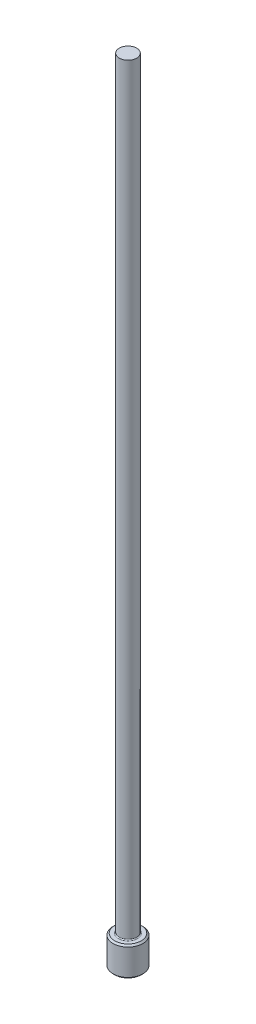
from build123d import *

# Parameters (mm, degrees)
CHAMFER1_SIZE = 0.127
FILLET1_R     = 0.0762


with BuildPart() as part:
    # Sketch1 → Revolve1 (revolve)
    with BuildSketch(Plane.XY, mode=Mode.PRIVATE) as revolve1_sk:
        Polygon((0, 0), (-1.1938, 0), (-1.1938, 2.3622), (-0.6985, 2.3622), (-0.6985, 63.5), (0, 63.5), align=None)
    revolve(revolve1_sk.sketch.rotate(Axis((0, 259.958771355, 0), (0, -1, 0)), 270), axis=Axis((0, 259.958771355, 0), (0, -1, 0)))

    # Chamfer1
    chamfer1_edges = [part.edges().sort_by_distance(p)[0] for p in [
        (0, 2.3622, -1.1938),
        (0, 0, -1.1938),
    ]]
    chamfer(chamfer1_edges, length=CHAMFER1_SIZE)

    # Fillet1
    fillet1_edges = [part.edges().sort_by_distance(p)[0] for p in [
        (0, 2.3622, -0.6985),
    ]]
    fillet(fillet1_edges, radius=FILLET1_R)


solid = part.part
